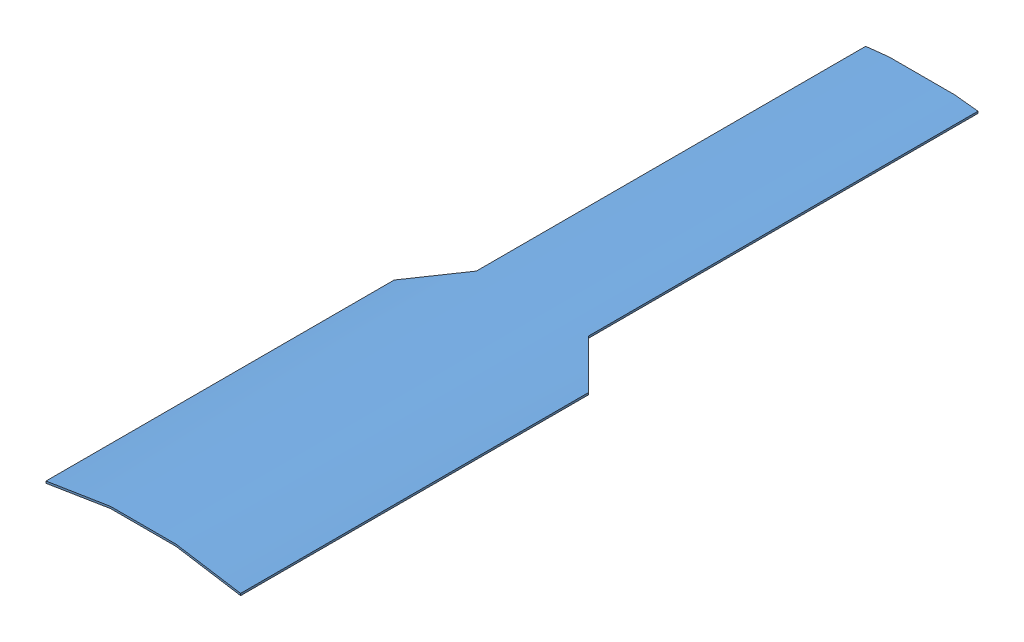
SolidWorks assembly Strain Gauge Assembly.SLDASM, configuration Default (file format 3100). Lengths in mm.
Overall size (12.7 0.89 50.81).
2 component instances, 2 part files, 1 mates.
Components (placement in the parent):
- strain gauge part 1-1: strain gauge part 1.SLDPRT [Default] at (6.3921 -8.7572 2.5765) size (12.7 0.89 50.8)
- strain gauge part 2-1: strain gauge part 2.SLDPRT [Default] at (6.3921 -8.7572 2.5692) x (1 -0.000769 0) z (0 0 1) size (11.18 0.6 50.04)
Mates (geometry in assembly coordinates):
- Concentric1: concentric aligned: cylinder of strain gauge part 1-1; cylinder of strain gauge part 2-1
